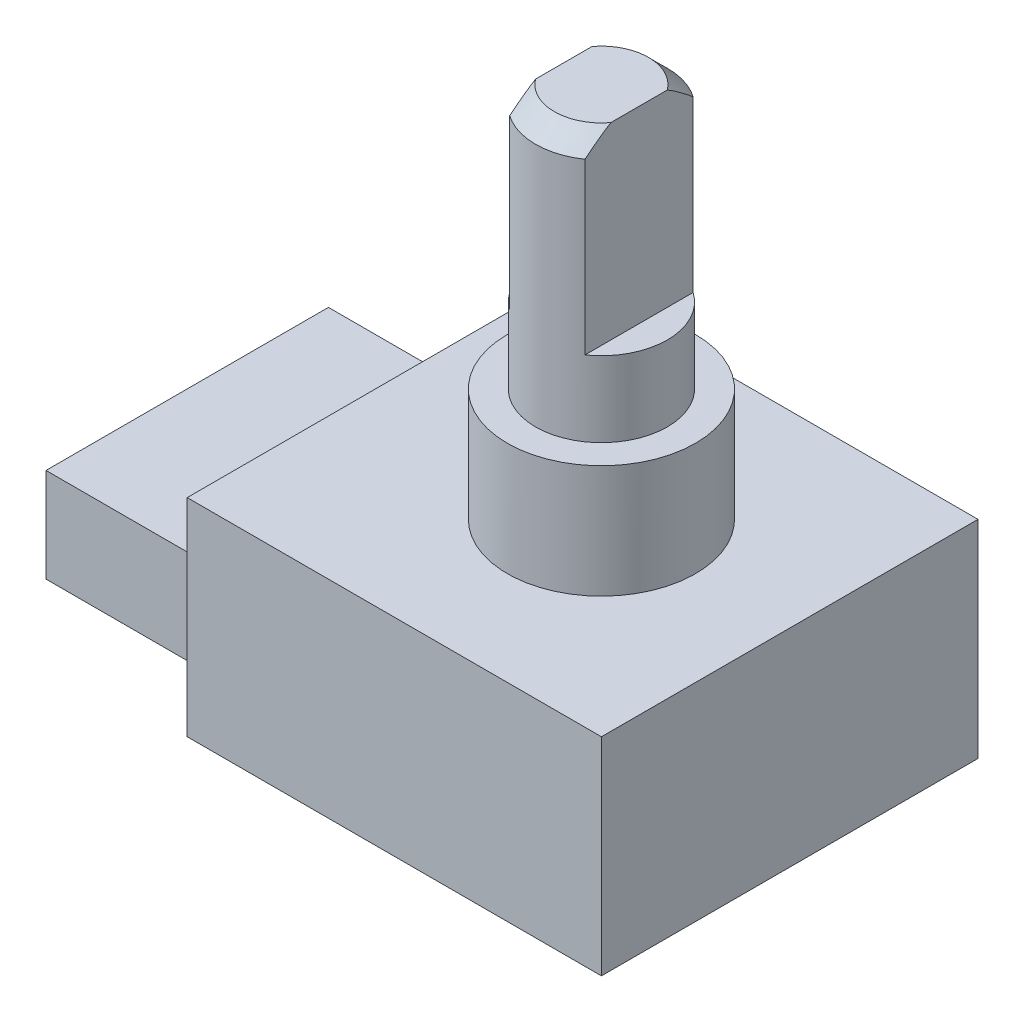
from build123d import *

# Parameters (mm, degrees)
SKICA1_R                      = 2.5
P_IDAT_VYSUNUT_M1_DEPTH       = 3
SKICA2_R                      = 1.75
P_IDAT_VYSUNUT_M2_DEPTH       = 7
ZKOSEN_1_SIZE                 = 0.5
ODEBRAT_VYSUNUT_M1_DEPTH      = 11.606601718
ODEBRAT_VYSUNUT_M1_DEPTH_BACK = 11.606601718
SKICA4_W                      = 0.75
SKICA4_H                      = 5
SKICA5_W                      = 11
SKICA5_H                      = 10
P_IDAT_VYSUNUT_M3_DEPTH       = 5.5
SKICA6_W                      = 7.5
SKICA6_H                      = 2.5
P_IDAT_VYSUNUT_M4_DEPTH       = 5


with BuildPart() as part:
    # Skica1 → P_idat vysunut_m1 (new body)
    with BuildSketch(Plane(origin=(0, 0, 0), x_dir=(1, 0, 0), z_dir=(0, 1, 0))):
        with Locations(Location((0, 0, 0), (0, 0, 270))):
            Circle(SKICA1_R)
    extrude(amount=P_IDAT_VYSUNUT_M1_DEPTH)

    # Skica2 → P_idat vysunut_m2 (add)
    with BuildSketch(Plane(origin=(0, 3, 0), x_dir=(1, 0, 0), z_dir=(0, 1, 0))):
        with Locations(Location((0, 0, 0), (0, 0, 270))):
            Circle(SKICA2_R)
    extrude(amount=P_IDAT_VYSUNUT_M2_DEPTH)

    # Zkosen_1
    zkosen_1_edges = [part.edges().sort_by_distance(p)[0] for p in [
        (0, 10, -1.75),
    ]]
    chamfer(zkosen_1_edges, length=ZKOSEN_1_SIZE)

    # Skica4 → Odebrat vysunut_m1 (cut, two sides: drawn at the far end of the back side and taken through both)
    with BuildSketch(Plane.XY.offset(-ODEBRAT_VYSUNUT_M1_DEPTH_BACK)):
        with Locations((1.375, 7.5)):
            Rectangle(SKICA4_W, SKICA4_H)
        with Locations((-1.375, 7.5)):
            Rectangle(SKICA4_W, SKICA4_H)
    extrude(amount=ODEBRAT_VYSUNUT_M1_DEPTH + ODEBRAT_VYSUNUT_M1_DEPTH_BACK, mode=Mode.SUBTRACT)

    # Skica5 → P_idat vysunut_m3 (add)
    with BuildSketch(Plane(origin=(0, 0, 0), x_dir=(1, 0, 0), z_dir=(0, 1, 0))):
        with Locations((-0.5, 0)):
            Rectangle(SKICA5_W, SKICA5_H)
    extrude(amount=-P_IDAT_VYSUNUT_M3_DEPTH)

    # Skica6 → P_idat vysunut_m4 (add)
    with BuildSketch(Plane.ZY.offset(6)):
        with Locations((0, -3.75)):
            Rectangle(SKICA6_W, SKICA6_H)
    extrude(amount=P_IDAT_VYSUNUT_M4_DEPTH)


solid = part.part
